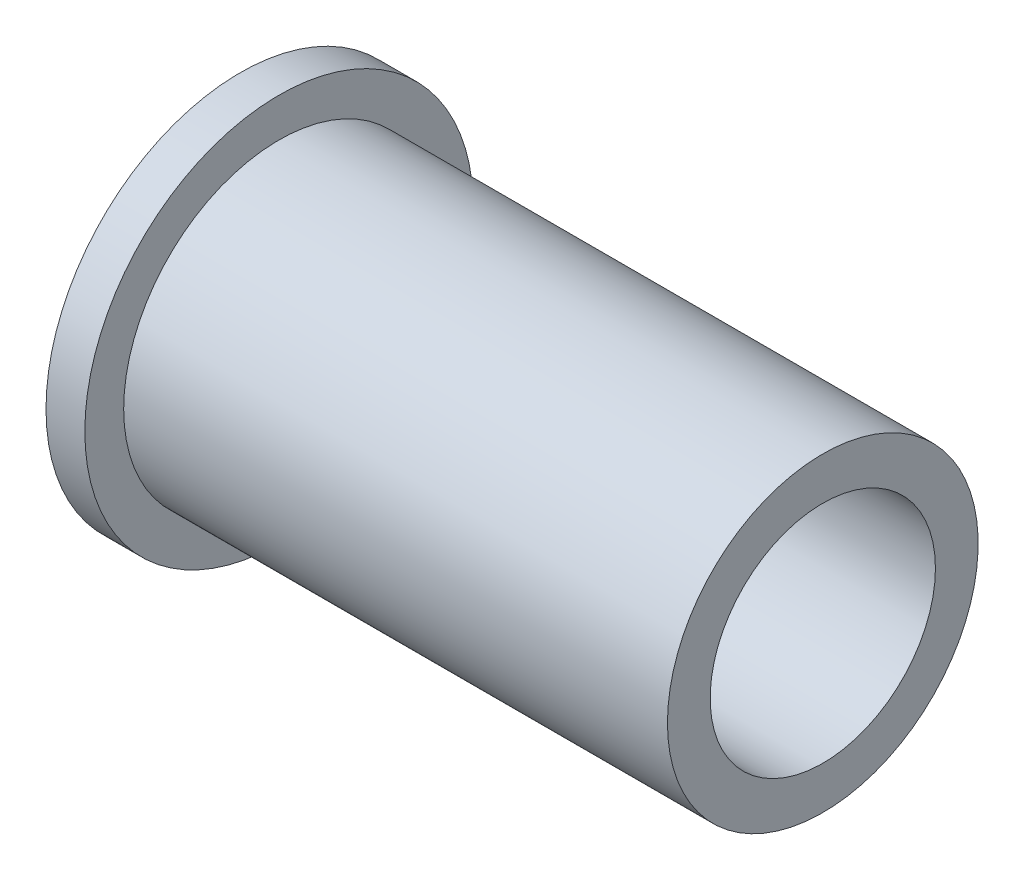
from build123d import *

# Parameters (mm, degrees)
FURO_COM_FOLGA_DE_M51_D     = 5.8
FURO_COM_FOLGA_DE_M51_DEPTH = 6
FURO_COM_FOLGA_DE_M51_TIP   = 1.171676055
DOMO1_FACE_RADIUS           = 5
DOMO1_HEIGHT                = 0.5


with BuildPart() as part:
    # Sketch2 → Revolve1 (revolve)
    with BuildSketch(Plane.XY, mode=Mode.PRIVATE) as revolve1_sk:
        Polygon((-10, 0), (-10, 5), (-9, 5), (-9, 4), (5, 4), (5, 0), align=None)
    revolve(revolve1_sk.sketch.rotate(Axis((-33.61911958, 0, 0), (1, 0, 0)), 90), axis=Axis((-33.61911958, 0, 0), (1, 0, 0)))

    # Furo com folga de M51
    with Locations(Plane(origin=(5, 0, 0), x_dir=(0, 0, -1), z_dir=(1, 0, 0))):
        with Locations((0, 0)):
            Hole(FURO_COM_FOLGA_DE_M51_D / 2, depth=FURO_COM_FOLGA_DE_M51_DEPTH)
            with Locations((0, 0, -(FURO_COM_FOLGA_DE_M51_DEPTH + FURO_COM_FOLGA_DE_M51_TIP / 2))):  # 136° drill point
                Cone(0, FURO_COM_FOLGA_DE_M51_D / 2, FURO_COM_FOLGA_DE_M51_TIP, mode=Mode.SUBTRACT)

    # Domo1: a dome of height H over a round flat face of radius A is a cap of a sphere of radius (A * A + H * H) / (2 * H)
    domo1_r = (DOMO1_FACE_RADIUS * DOMO1_FACE_RADIUS + DOMO1_HEIGHT * DOMO1_HEIGHT) / (2 * DOMO1_HEIGHT)
    domo1_base = Plane((-10, 0, 0), z_dir=(-1, 0, 0))
    with Locations(domo1_base.offset(DOMO1_HEIGHT - domo1_r)):
        domo1_ball = Sphere(domo1_r, mode=Mode.PRIVATE)
    add(split(domo1_ball, bisect_by=domo1_base, keep=Keep.TOP, mode=Mode.PRIVATE))


solid = part.part
